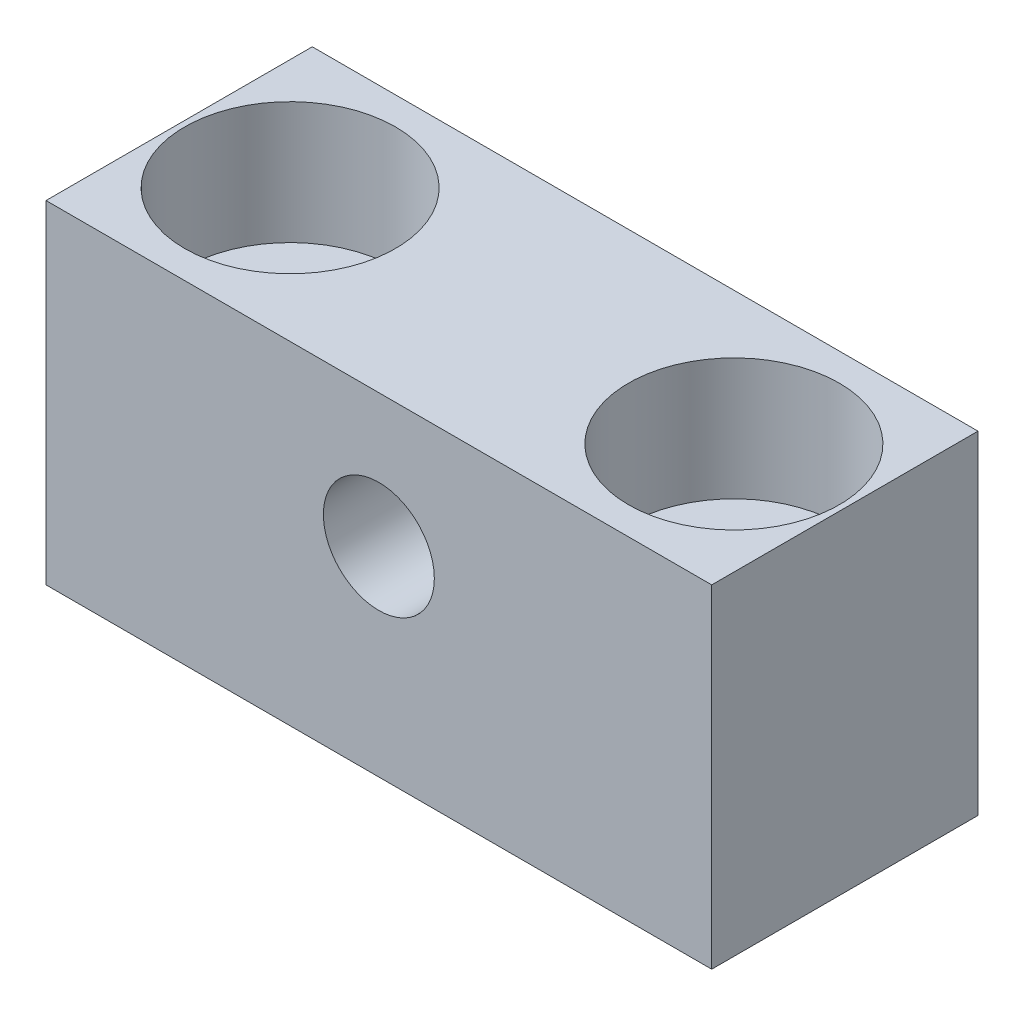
ISO-10303-21;
HEADER;
FILE_DESCRIPTION(('STEP AP214'),'2;1');
FILE_NAME('part.step','',(''),(''),'','','');
FILE_SCHEMA(('AUTOMOTIVE_DESIGN { 1 0 10303 214 1 1 1 1 }'));
ENDSEC;
DATA;
#1=APPLICATION_CONTEXT('core data for automotive mechanical design processes');
#2=APPLICATION_PROTOCOL_DEFINITION('international standard','automotive_design',2000,#1);
#3=PRODUCT_CONTEXT('',#1,'mechanical');
#4=PRODUCT('Part','Part','',(#3));
#5=PRODUCT_RELATED_PRODUCT_CATEGORY('part','',(#4));
#6=PRODUCT_DEFINITION_FORMATION('','',#4);
#7=PRODUCT_DEFINITION_CONTEXT('part definition',#1,'design');
#8=PRODUCT_DEFINITION('design','',#6,#7);
#9=PRODUCT_DEFINITION_SHAPE('','',#8);
#10=(LENGTH_UNIT() NAMED_UNIT(*) SI_UNIT(.MILLI.,.METRE.));
#11=(NAMED_UNIT(*) PLANE_ANGLE_UNIT() SI_UNIT($,.RADIAN.));
#12=(NAMED_UNIT(*) SI_UNIT($,.STERADIAN.) SOLID_ANGLE_UNIT());
#13=UNCERTAINTY_MEASURE_WITH_UNIT(LENGTH_MEASURE(1.E-05),#10,'distance_accuracy_value','');
#14=(GEOMETRIC_REPRESENTATION_CONTEXT(3) GLOBAL_UNCERTAINTY_ASSIGNED_CONTEXT((#13)) GLOBAL_UNIT_ASSIGNED_CONTEXT((#10,
#11,#12)) REPRESENTATION_CONTEXT('',''));
#15=CARTESIAN_POINT('',(0.,0.,0.));
#16=DIRECTION('',(0.,0.,1.));
#17=DIRECTION('',(1.,0.,0.));
#18=AXIS2_PLACEMENT_3D('',#15,#16,#17);
#19=CARTESIAN_POINT('',(5.,-0.000999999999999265,6.));
#20=DIRECTION('',(0.,1.,0.));
#21=DIRECTION('',(0.,0.,1.));
#22=AXIS2_PLACEMENT_3D('',#19,#20,#21);
#23=CYLINDRICAL_SURFACE('',#22,2.75);
#24=CARTESIAN_POINT('',(5.,0.,6.));
#25=DIRECTION('',(0.,1.,0.));
#26=DIRECTION('',(0.,0.,1.));
#27=AXIS2_PLACEMENT_3D('',#24,#25,#26);
#28=CIRCLE('',#27,2.75);
#29=CARTESIAN_POINT('',(5.,0.,8.75));
#30=VERTEX_POINT('',#29);
#31=EDGE_CURVE('E110',#30,#30,#28,.F.);
#32=CARTESIAN_POINT('',(5.,9.5,6.));
#33=DIRECTION('',(0.,1.,0.));
#34=DIRECTION('',(0.,0.,1.));
#35=AXIS2_PLACEMENT_3D('',#32,#33,#34);
#36=CIRCLE('',#35,2.75);
#37=CARTESIAN_POINT('',(5.,9.5,8.75));
#38=VERTEX_POINT('',#37);
#39=EDGE_CURVE('E36',#38,#38,#36,.F.);
#40=CARTESIAN_POINT('',(5.,0.,8.75));
#41=CARTESIAN_POINT('',(5.,0.0989583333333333,8.75));
#42=CARTESIAN_POINT('',(5.,0.197916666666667,8.75));
#43=CARTESIAN_POINT('',(5.,0.395833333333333,8.75));
#44=CARTESIAN_POINT('',(5.,0.494791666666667,8.75));
#45=CARTESIAN_POINT('',(5.,0.692708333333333,8.75));
#46=CARTESIAN_POINT('',(5.,0.791666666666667,8.75));
#47=CARTESIAN_POINT('',(5.,0.989583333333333,8.75));
#48=CARTESIAN_POINT('',(5.,1.08854166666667,8.75));
#49=CARTESIAN_POINT('',(5.,1.28645833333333,8.75));
#50=CARTESIAN_POINT('',(5.,1.38541666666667,8.75));
#51=CARTESIAN_POINT('',(5.,1.58333333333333,8.75));
#52=CARTESIAN_POINT('',(5.,1.68229166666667,8.75));
#53=CARTESIAN_POINT('',(5.,1.88020833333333,8.75));
#54=CARTESIAN_POINT('',(5.,1.97916666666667,8.75));
#55=CARTESIAN_POINT('',(5.,2.17708333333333,8.75));
#56=CARTESIAN_POINT('',(5.,2.27604166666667,8.75));
#57=CARTESIAN_POINT('',(5.,2.47395833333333,8.75));
#58=CARTESIAN_POINT('',(5.,2.57291666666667,8.75));
#59=CARTESIAN_POINT('',(5.,2.77083333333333,8.75));
#60=CARTESIAN_POINT('',(5.,2.86979166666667,8.75));
#61=CARTESIAN_POINT('',(5.,3.06770833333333,8.75));
#62=CARTESIAN_POINT('',(5.,3.16666666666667,8.75));
#63=CARTESIAN_POINT('',(5.,3.36458333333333,8.75));
#64=CARTESIAN_POINT('',(5.,3.46354166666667,8.75));
#65=CARTESIAN_POINT('',(5.,3.66145833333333,8.75));
#66=CARTESIAN_POINT('',(5.,3.76041666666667,8.75));
#67=CARTESIAN_POINT('',(5.,3.95833333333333,8.75));
#68=CARTESIAN_POINT('',(5.,4.05729166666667,8.75));
#69=CARTESIAN_POINT('',(5.,4.25520833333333,8.75));
#70=CARTESIAN_POINT('',(5.,4.35416666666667,8.75));
#71=CARTESIAN_POINT('',(5.,4.55208333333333,8.75));
#72=CARTESIAN_POINT('',(5.,4.65104166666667,8.75));
#73=CARTESIAN_POINT('',(5.,4.84895833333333,8.75));
#74=CARTESIAN_POINT('',(5.,4.94791666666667,8.75));
#75=CARTESIAN_POINT('',(5.,5.14583333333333,8.75));
#76=CARTESIAN_POINT('',(5.,5.24479166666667,8.75));
#77=CARTESIAN_POINT('',(5.,5.44270833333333,8.75));
#78=CARTESIAN_POINT('',(5.,5.54166666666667,8.75));
#79=CARTESIAN_POINT('',(5.,5.73958333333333,8.75));
#80=CARTESIAN_POINT('',(5.,5.83854166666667,8.75));
#81=CARTESIAN_POINT('',(5.,6.03645833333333,8.75));
#82=CARTESIAN_POINT('',(5.,6.13541666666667,8.75));
#83=CARTESIAN_POINT('',(5.,6.33333333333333,8.75));
#84=CARTESIAN_POINT('',(5.,6.43229166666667,8.75));
#85=CARTESIAN_POINT('',(5.,6.63020833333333,8.75));
#86=CARTESIAN_POINT('',(5.,6.72916666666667,8.75));
#87=CARTESIAN_POINT('',(5.,6.92708333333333,8.75));
#88=CARTESIAN_POINT('',(5.,7.02604166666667,8.75));
#89=CARTESIAN_POINT('',(5.,7.22395833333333,8.75));
#90=CARTESIAN_POINT('',(5.,7.32291666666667,8.75));
#91=CARTESIAN_POINT('',(5.,7.52083333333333,8.75));
#92=CARTESIAN_POINT('',(5.,7.61979166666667,8.75));
#93=CARTESIAN_POINT('',(5.,7.81770833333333,8.75));
#94=CARTESIAN_POINT('',(5.,7.91666666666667,8.75));
#95=CARTESIAN_POINT('',(5.,8.11458333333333,8.75));
#96=CARTESIAN_POINT('',(5.,8.21354166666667,8.75));
#97=CARTESIAN_POINT('',(5.,8.41145833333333,8.75));
#98=CARTESIAN_POINT('',(5.,8.51041666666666,8.75));
#99=CARTESIAN_POINT('',(5.,8.70833333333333,8.75));
#100=CARTESIAN_POINT('',(5.,8.80729166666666,8.75));
#101=CARTESIAN_POINT('',(5.,9.00520833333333,8.75));
#102=CARTESIAN_POINT('',(5.,9.10416666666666,8.75));
#103=CARTESIAN_POINT('',(5.,9.30208333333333,8.75));
#104=CARTESIAN_POINT('',(5.,9.40104166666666,8.75));
#105=CARTESIAN_POINT('',(5.,9.5,8.75));
#106=B_SPLINE_CURVE_WITH_KNOTS('',3,(#40,#41,#42,#43,#44,#45,#46,#47,#48,#49,#50,#51,#52,#53,
#54,#55,#56,#57,#58,#59,#60,#61,#62,#63,#64,#65,#66,#67,#68,#69,#70,#71,#72,#73,#74,#75,#76,#77,
#78,#79,#80,#81,#82,#83,#84,#85,#86,#87,#88,#89,#90,#91,#92,#93,#94,#95,#96,#97,#98,#99,#100,
#101,#102,#103,#104,#105),.UNSPECIFIED.,.F.,.F.,(4,2,2,2,2,2,2,2,2,2,2,2,2,2,2,2,2,2,2,2,2,2,2,
2,2,2,2,2,2,2,2,2,4),(0.,0.296875,0.59375,0.890625,1.1875,1.484375,1.78125,2.078125,2.375,
2.671875,2.96875,3.265625,3.5625,3.859375,4.15625,4.453125,4.75,5.046875,5.34375,5.640625,
5.9375,6.234375,6.53125,6.828125,7.125,7.421875,7.71875,8.015625,8.3125,8.609375,8.90625,
9.203125,9.5),.UNSPECIFIED.);
#107=EDGE_CURVE('BSEAM32',#30,#38,#106,.T.);
#108=ORIENTED_EDGE('',*,*,#31,.T.);
#109=ORIENTED_EDGE('',*,*,#39,.F.);
#110=ORIENTED_EDGE('',*,*,#107,.T.);
#111=ORIENTED_EDGE('',*,*,#107,.F.);
#112=EDGE_LOOP('',(#108,#110,#109,#111));
#113=FACE_BOUND('',#112,.T.);
#114=ADVANCED_FACE('F32',(#113),#23,.F.);
#115=CARTESIAN_POINT('',(25.,-0.000999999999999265,6.));
#116=DIRECTION('',(0.,1.,0.));
#117=DIRECTION('',(0.,0.,1.));
#118=AXIS2_PLACEMENT_3D('',#115,#116,#117);
#119=CYLINDRICAL_SURFACE('',#118,2.75);
#120=CARTESIAN_POINT('',(25.,0.,6.));
#121=DIRECTION('',(0.,1.,0.));
#122=DIRECTION('',(0.,0.,1.));
#123=AXIS2_PLACEMENT_3D('',#120,#121,#122);
#124=CIRCLE('',#123,2.75);
#125=CARTESIAN_POINT('',(25.,0.,8.75));
#126=VERTEX_POINT('',#125);
#127=EDGE_CURVE('E115',#126,#126,#124,.F.);
#128=CARTESIAN_POINT('',(25.,9.5,6.));
#129=DIRECTION('',(0.,1.,0.));
#130=DIRECTION('',(0.,0.,1.));
#131=AXIS2_PLACEMENT_3D('',#128,#129,#130);
#132=CIRCLE('',#131,2.75);
#133=CARTESIAN_POINT('',(25.,9.5,8.75));
#134=VERTEX_POINT('',#133);
#135=EDGE_CURVE('E108',#134,#134,#132,.F.);
#136=CARTESIAN_POINT('',(25.,0.,8.75));
#137=CARTESIAN_POINT('',(25.,0.0989583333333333,8.75));
#138=CARTESIAN_POINT('',(25.,0.197916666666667,8.75));
#139=CARTESIAN_POINT('',(25.,0.395833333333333,8.75));
#140=CARTESIAN_POINT('',(25.,0.494791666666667,8.75));
#141=CARTESIAN_POINT('',(25.,0.692708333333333,8.75));
#142=CARTESIAN_POINT('',(25.,0.791666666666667,8.75));
#143=CARTESIAN_POINT('',(25.,0.989583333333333,8.75));
#144=CARTESIAN_POINT('',(25.,1.08854166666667,8.75));
#145=CARTESIAN_POINT('',(25.,1.28645833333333,8.75));
#146=CARTESIAN_POINT('',(25.,1.38541666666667,8.75));
#147=CARTESIAN_POINT('',(25.,1.58333333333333,8.75));
#148=CARTESIAN_POINT('',(25.,1.68229166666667,8.75));
#149=CARTESIAN_POINT('',(25.,1.88020833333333,8.75));
#150=CARTESIAN_POINT('',(25.,1.97916666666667,8.75));
#151=CARTESIAN_POINT('',(25.,2.17708333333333,8.75));
#152=CARTESIAN_POINT('',(25.,2.27604166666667,8.75));
#153=CARTESIAN_POINT('',(25.,2.47395833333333,8.75));
#154=CARTESIAN_POINT('',(25.,2.57291666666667,8.75));
#155=CARTESIAN_POINT('',(25.,2.77083333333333,8.75));
#156=CARTESIAN_POINT('',(25.,2.86979166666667,8.75));
#157=CARTESIAN_POINT('',(25.,3.06770833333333,8.75));
#158=CARTESIAN_POINT('',(25.,3.16666666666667,8.75));
#159=CARTESIAN_POINT('',(25.,3.36458333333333,8.75));
#160=CARTESIAN_POINT('',(25.,3.46354166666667,8.75));
#161=CARTESIAN_POINT('',(25.,3.66145833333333,8.75));
#162=CARTESIAN_POINT('',(25.,3.76041666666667,8.75));
#163=CARTESIAN_POINT('',(25.,3.95833333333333,8.75));
#164=CARTESIAN_POINT('',(25.,4.05729166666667,8.75));
#165=CARTESIAN_POINT('',(25.,4.25520833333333,8.75));
#166=CARTESIAN_POINT('',(25.,4.35416666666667,8.75));
#167=CARTESIAN_POINT('',(25.,4.55208333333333,8.75));
#168=CARTESIAN_POINT('',(25.,4.65104166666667,8.75));
#169=CARTESIAN_POINT('',(25.,4.84895833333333,8.75));
#170=CARTESIAN_POINT('',(25.,4.94791666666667,8.75));
#171=CARTESIAN_POINT('',(25.,5.14583333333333,8.75));
#172=CARTESIAN_POINT('',(25.,5.24479166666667,8.75));
#173=CARTESIAN_POINT('',(25.,5.44270833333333,8.75));
#174=CARTESIAN_POINT('',(25.,5.54166666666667,8.75));
#175=CARTESIAN_POINT('',(25.,5.73958333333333,8.75));
#176=CARTESIAN_POINT('',(25.,5.83854166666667,8.75));
#177=CARTESIAN_POINT('',(25.,6.03645833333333,8.75));
#178=CARTESIAN_POINT('',(25.,6.13541666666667,8.75));
#179=CARTESIAN_POINT('',(25.,6.33333333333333,8.75));
#180=CARTESIAN_POINT('',(25.,6.43229166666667,8.75));
#181=CARTESIAN_POINT('',(25.,6.63020833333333,8.75));
#182=CARTESIAN_POINT('',(25.,6.72916666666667,8.75));
#183=CARTESIAN_POINT('',(25.,6.92708333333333,8.75));
#184=CARTESIAN_POINT('',(25.,7.02604166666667,8.75));
#185=CARTESIAN_POINT('',(25.,7.22395833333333,8.75));
#186=CARTESIAN_POINT('',(25.,7.32291666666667,8.75));
#187=CARTESIAN_POINT('',(25.,7.52083333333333,8.75));
#188=CARTESIAN_POINT('',(25.,7.61979166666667,8.75));
#189=CARTESIAN_POINT('',(25.,7.81770833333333,8.75));
#190=CARTESIAN_POINT('',(25.,7.91666666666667,8.75));
#191=CARTESIAN_POINT('',(25.,8.11458333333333,8.75));
#192=CARTESIAN_POINT('',(25.,8.21354166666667,8.75));
#193=CARTESIAN_POINT('',(25.,8.41145833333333,8.75));
#194=CARTESIAN_POINT('',(25.,8.51041666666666,8.75));
#195=CARTESIAN_POINT('',(25.,8.70833333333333,8.75));
#196=CARTESIAN_POINT('',(25.,8.80729166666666,8.75));
#197=CARTESIAN_POINT('',(25.,9.00520833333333,8.75));
#198=CARTESIAN_POINT('',(25.,9.10416666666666,8.75));
#199=CARTESIAN_POINT('',(25.,9.30208333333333,8.75));
#200=CARTESIAN_POINT('',(25.,9.40104166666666,8.75));
#201=CARTESIAN_POINT('',(25.,9.5,8.75));
#202=B_SPLINE_CURVE_WITH_KNOTS('',3,(#136,#137,#138,#139,#140,#141,#142,#143,#144,#145,#146,
#147,#148,#149,#150,#151,#152,#153,#154,#155,#156,#157,#158,#159,#160,#161,#162,#163,#164,#165,
#166,#167,#168,#169,#170,#171,#172,#173,#174,#175,#176,#177,#178,#179,#180,#181,#182,#183,#184,
#185,#186,#187,#188,#189,#190,#191,#192,#193,#194,#195,#196,#197,#198,#199,#200,#201),
.UNSPECIFIED.,.F.,.F.,(4,2,2,2,2,2,2,2,2,2,2,2,2,2,2,2,2,2,2,2,2,2,2,2,2,2,2,2,2,2,2,2,4),(0.,
0.296875,0.59375,0.890625,1.1875,1.484375,1.78125,2.078125,2.375,2.671875,2.96875,3.265625,
3.5625,3.859375,4.15625,4.453125,4.75,5.046875,5.34375,5.640625,5.9375,6.234375,6.53125,
6.828125,7.125,7.421875,7.71875,8.015625,8.3125,8.609375,8.90625,9.203125,9.5),.UNSPECIFIED.);
#203=EDGE_CURVE('BSEAM155',#126,#134,#202,.T.);
#204=ORIENTED_EDGE('',*,*,#127,.T.);
#205=ORIENTED_EDGE('',*,*,#135,.F.);
#206=ORIENTED_EDGE('',*,*,#203,.T.);
#207=ORIENTED_EDGE('',*,*,#203,.F.);
#208=EDGE_LOOP('',(#204,#206,#205,#207));
#209=FACE_BOUND('',#208,.T.);
#210=ADVANCED_FACE('F155',(#209),#119,.F.);
#211=CARTESIAN_POINT('',(0.,15.,12.));
#212=DIRECTION('',(0.,0.,-1.));
#213=DIRECTION('',(-1.,0.,0.));
#214=AXIS2_PLACEMENT_3D('',#211,#212,#213);
#215=PLANE('',#214);
#216=DIRECTION('',(0.,-1.,0.));
#217=VECTOR('',#216,1.);
#218=CARTESIAN_POINT('',(0.,0.,12.));
#219=LINE('',#218,#217);
#220=CARTESIAN_POINT('',(0.,15.,12.));
#221=VERTEX_POINT('',#220);
#222=CARTESIAN_POINT('',(0.,0.,12.));
#223=VERTEX_POINT('',#222);
#224=EDGE_CURVE('E87',#221,#223,#219,.T.);
#225=ORIENTED_EDGE('',*,*,#224,.T.);
#226=DIRECTION('',(1.,0.,0.));
#227=VECTOR('',#226,1.);
#228=CARTESIAN_POINT('',(0.,0.,12.));
#229=LINE('',#228,#227);
#230=CARTESIAN_POINT('',(30.,0.,12.));
#231=VERTEX_POINT('',#230);
#232=EDGE_CURVE('E81',#223,#231,#229,.T.);
#233=ORIENTED_EDGE('',*,*,#232,.T.);
#234=DIRECTION('',(0.,1.,0.));
#235=VECTOR('',#234,1.);
#236=CARTESIAN_POINT('',(30.,0.,12.));
#237=LINE('',#236,#235);
#238=CARTESIAN_POINT('',(30.,15.,12.));
#239=VERTEX_POINT('',#238);
#240=EDGE_CURVE('E85',#231,#239,#237,.T.);
#241=ORIENTED_EDGE('',*,*,#240,.T.);
#242=DIRECTION('',(-1.,0.,0.));
#243=VECTOR('',#242,1.);
#244=CARTESIAN_POINT('',(0.,15.,12.));
#245=LINE('',#244,#243);
#246=EDGE_CURVE('E51',#239,#221,#245,.T.);
#247=ORIENTED_EDGE('',*,*,#246,.T.);
#248=EDGE_LOOP('',(#225,#233,#241,#247));
#249=FACE_BOUND('',#248,.T.);
#250=CARTESIAN_POINT('',(15.,9.,12.));
#251=DIRECTION('',(0.,0.,1.));
#252=DIRECTION('',(1.,0.,0.));
#253=AXIS2_PLACEMENT_3D('',#250,#251,#252);
#254=CIRCLE('',#253,2.5);
#255=CARTESIAN_POINT('',(17.5,9.,12.));
#256=VERTEX_POINT('',#255);
#257=EDGE_CURVE('E103',#256,#256,#254,.T.);
#258=ORIENTED_EDGE('',*,*,#257,.F.);
#259=EDGE_LOOP('',(#258));
#260=FACE_BOUND('',#259,.T.);
#261=ADVANCED_FACE('F82',(#249,#260),#215,.F.);
#262=CARTESIAN_POINT('',(0.,15.,0.));
#263=DIRECTION('',(0.,0.,-1.));
#264=DIRECTION('',(-1.,0.,0.));
#265=AXIS2_PLACEMENT_3D('',#262,#263,#264);
#266=PLANE('',#265);
#267=DIRECTION('',(0.,-1.,0.));
#268=VECTOR('',#267,1.);
#269=CARTESIAN_POINT('',(0.,0.,0.));
#270=LINE('',#269,#268);
#271=CARTESIAN_POINT('',(0.,15.,0.));
#272=VERTEX_POINT('',#271);
#273=CARTESIAN_POINT('',(0.,0.,0.));
#274=VERTEX_POINT('',#273);
#275=EDGE_CURVE('E100',#272,#274,#270,.T.);
#276=ORIENTED_EDGE('',*,*,#275,.F.);
#277=DIRECTION('',(-1.,0.,0.));
#278=VECTOR('',#277,1.);
#279=CARTESIAN_POINT('',(0.,15.,0.));
#280=LINE('',#279,#278);
#281=CARTESIAN_POINT('',(30.,15.,0.));
#282=VERTEX_POINT('',#281);
#283=EDGE_CURVE('E74',#282,#272,#280,.T.);
#284=ORIENTED_EDGE('',*,*,#283,.F.);
#285=DIRECTION('',(0.,1.,0.));
#286=VECTOR('',#285,1.);
#287=CARTESIAN_POINT('',(30.,0.,0.));
#288=LINE('',#287,#286);
#289=CARTESIAN_POINT('',(30.,0.,0.));
#290=VERTEX_POINT('',#289);
#291=EDGE_CURVE('E68',#290,#282,#288,.T.);
#292=ORIENTED_EDGE('',*,*,#291,.F.);
#293=DIRECTION('',(1.,0.,0.));
#294=VECTOR('',#293,1.);
#295=CARTESIAN_POINT('',(0.,0.,0.));
#296=LINE('',#295,#294);
#297=EDGE_CURVE('E91',#274,#290,#296,.T.);
#298=ORIENTED_EDGE('',*,*,#297,.F.);
#299=EDGE_LOOP('',(#276,#284,#292,#298));
#300=FACE_BOUND('',#299,.T.);
#301=CARTESIAN_POINT('',(15.,9.,0.));
#302=DIRECTION('',(0.,0.,1.));
#303=DIRECTION('',(1.,0.,0.));
#304=AXIS2_PLACEMENT_3D('',#301,#302,#303);
#305=CIRCLE('',#304,2.5);
#306=CARTESIAN_POINT('',(17.5,9.,0.));
#307=VERTEX_POINT('',#306);
#308=EDGE_CURVE('E130',#307,#307,#305,.T.);
#309=ORIENTED_EDGE('',*,*,#308,.T.);
#310=EDGE_LOOP('',(#309));
#311=FACE_BOUND('',#310,.T.);
#312=ADVANCED_FACE('F136',(#300,#311),#266,.T.);
#313=CARTESIAN_POINT('',(0.,0.,12.));
#314=DIRECTION('',(1.,0.,0.));
#315=DIRECTION('',(0.,0.,-1.));
#316=AXIS2_PLACEMENT_3D('',#313,#314,#315);
#317=PLANE('',#316);
#318=ORIENTED_EDGE('',*,*,#275,.T.);
#319=DIRECTION('',(0.,0.,-1.));
#320=VECTOR('',#319,1.);
#321=CARTESIAN_POINT('',(0.,0.,12.));
#322=LINE('',#321,#320);
#323=EDGE_CURVE('E11',#223,#274,#322,.T.);
#324=ORIENTED_EDGE('',*,*,#323,.F.);
#325=ORIENTED_EDGE('',*,*,#224,.F.);
#326=DIRECTION('',(0.,0.,-1.));
#327=VECTOR('',#326,1.);
#328=CARTESIAN_POINT('',(0.,15.,12.));
#329=LINE('',#328,#327);
#330=EDGE_CURVE('E96',#221,#272,#329,.T.);
#331=ORIENTED_EDGE('',*,*,#330,.T.);
#332=EDGE_LOOP('',(#318,#324,#325,#331));
#333=FACE_BOUND('',#332,.T.);
#334=ADVANCED_FACE('F34',(#333),#317,.F.);
#335=CARTESIAN_POINT('',(0.,0.,12.));
#336=DIRECTION('',(0.,1.,0.));
#337=DIRECTION('',(0.,0.,1.));
#338=AXIS2_PLACEMENT_3D('',#335,#336,#337);
#339=PLANE('',#338);
#340=ORIENTED_EDGE('',*,*,#31,.F.);
#341=EDGE_LOOP('',(#340));
#342=FACE_BOUND('',#341,.T.);
#343=ORIENTED_EDGE('',*,*,#127,.F.);
#344=EDGE_LOOP('',(#343));
#345=FACE_BOUND('',#344,.T.);
#346=ORIENTED_EDGE('',*,*,#297,.T.);
#347=DIRECTION('',(0.,0.,-1.));
#348=VECTOR('',#347,1.);
#349=CARTESIAN_POINT('',(30.,0.,12.));
#350=LINE('',#349,#348);
#351=EDGE_CURVE('E42',#231,#290,#350,.T.);
#352=ORIENTED_EDGE('',*,*,#351,.F.);
#353=ORIENTED_EDGE('',*,*,#232,.F.);
#354=ORIENTED_EDGE('',*,*,#323,.T.);
#355=EDGE_LOOP('',(#346,#352,#353,#354));
#356=FACE_BOUND('',#355,.T.);
#357=ADVANCED_FACE('F90',(#342,#345,#356),#339,.F.);
#358=CARTESIAN_POINT('',(30.,0.,12.));
#359=DIRECTION('',(-1.,0.,0.));
#360=DIRECTION('',(0.,0.,1.));
#361=AXIS2_PLACEMENT_3D('',#358,#359,#360);
#362=PLANE('',#361);
#363=ORIENTED_EDGE('',*,*,#291,.T.);
#364=DIRECTION('',(0.,0.,-1.));
#365=VECTOR('',#364,1.);
#366=CARTESIAN_POINT('',(30.,15.,12.));
#367=LINE('',#366,#365);
#368=EDGE_CURVE('E92',#239,#282,#367,.T.);
#369=ORIENTED_EDGE('',*,*,#368,.F.);
#370=ORIENTED_EDGE('',*,*,#240,.F.);
#371=ORIENTED_EDGE('',*,*,#351,.T.);
#372=EDGE_LOOP('',(#363,#369,#370,#371));
#373=FACE_BOUND('',#372,.T.);
#374=ADVANCED_FACE('F94',(#373),#362,.F.);
#375=CARTESIAN_POINT('',(0.,15.,12.));
#376=DIRECTION('',(0.,-1.,0.));
#377=DIRECTION('',(0.,0.,-1.));
#378=AXIS2_PLACEMENT_3D('',#375,#376,#377);
#379=PLANE('',#378);
#380=CARTESIAN_POINT('',(5.,15.,6.));
#381=DIRECTION('',(0.,1.,0.));
#382=DIRECTION('',(0.,0.,1.));
#383=AXIS2_PLACEMENT_3D('',#380,#381,#382);
#384=CIRCLE('',#383,4.75);
#385=CARTESIAN_POINT('',(5.,15.,10.75));
#386=VERTEX_POINT('',#385);
#387=EDGE_CURVE('E125',#386,#386,#384,.T.);
#388=ORIENTED_EDGE('',*,*,#387,.F.);
#389=EDGE_LOOP('',(#388));
#390=FACE_BOUND('',#389,.T.);
#391=CARTESIAN_POINT('',(25.,15.,6.));
#392=DIRECTION('',(0.,1.,0.));
#393=DIRECTION('',(0.,0.,1.));
#394=AXIS2_PLACEMENT_3D('',#391,#392,#393);
#395=CIRCLE('',#394,4.75);
#396=CARTESIAN_POINT('',(25.,15.,10.75));
#397=VERTEX_POINT('',#396);
#398=EDGE_CURVE('E118',#397,#397,#395,.T.);
#399=ORIENTED_EDGE('',*,*,#398,.F.);
#400=EDGE_LOOP('',(#399));
#401=FACE_BOUND('',#400,.T.);
#402=ORIENTED_EDGE('',*,*,#283,.T.);
#403=ORIENTED_EDGE('',*,*,#330,.F.);
#404=ORIENTED_EDGE('',*,*,#246,.F.);
#405=ORIENTED_EDGE('',*,*,#368,.T.);
#406=EDGE_LOOP('',(#402,#403,#404,#405));
#407=FACE_BOUND('',#406,.T.);
#408=ADVANCED_FACE('F141',(#390,#401,#407),#379,.F.);
#409=CARTESIAN_POINT('',(15.,9.,12.));
#410=DIRECTION('',(0.,0.,-1.));
#411=DIRECTION('',(-1.,0.,0.));
#412=AXIS2_PLACEMENT_3D('',#409,#410,#411);
#413=CYLINDRICAL_SURFACE('',#412,2.5);
#414=ORIENTED_EDGE('',*,*,#257,.T.);
#415=EDGE_LOOP('',(#414));
#416=FACE_BOUND('',#415,.T.);
#417=ORIENTED_EDGE('',*,*,#308,.F.);
#418=EDGE_LOOP('',(#417));
#419=FACE_BOUND('',#418,.T.);
#420=ADVANCED_FACE('F138',(#416,#419),#413,.F.);
#421=CARTESIAN_POINT('',(25.,9.5,6.));
#422=DIRECTION('',(0.,1.,0.));
#423=DIRECTION('',(0.,0.,1.));
#424=AXIS2_PLACEMENT_3D('',#421,#422,#423);
#425=PLANE('',#424);
#426=CARTESIAN_POINT('',(25.,9.5,6.));
#427=DIRECTION('',(0.,1.,0.));
#428=DIRECTION('',(0.,0.,1.));
#429=AXIS2_PLACEMENT_3D('',#426,#427,#428);
#430=CIRCLE('',#429,4.75);
#431=CARTESIAN_POINT('',(25.,9.5,10.75));
#432=VERTEX_POINT('',#431);
#433=EDGE_CURVE('E111',#432,#432,#430,.T.);
#434=ORIENTED_EDGE('',*,*,#433,.T.);
#435=EDGE_LOOP('',(#434));
#436=FACE_BOUND('',#435,.T.);
#437=ORIENTED_EDGE('',*,*,#135,.T.);
#438=EDGE_LOOP('',(#437));
#439=FACE_BOUND('',#438,.T.);
#440=ADVANCED_FACE('F140',(#436,#439),#425,.T.);
#441=CARTESIAN_POINT('',(25.,9.5,6.));
#442=DIRECTION('',(0.,1.,0.));
#443=DIRECTION('',(0.,0.,1.));
#444=AXIS2_PLACEMENT_3D('',#441,#442,#443);
#445=CYLINDRICAL_SURFACE('',#444,4.75);
#446=ORIENTED_EDGE('',*,*,#433,.F.);
#447=EDGE_LOOP('',(#446));
#448=FACE_BOUND('',#447,.T.);
#449=ORIENTED_EDGE('',*,*,#398,.T.);
#450=EDGE_LOOP('',(#449));
#451=FACE_BOUND('',#450,.T.);
#452=ADVANCED_FACE('F148',(#448,#451),#445,.F.);
#453=CARTESIAN_POINT('',(5.,9.5,6.));
#454=DIRECTION('',(0.,1.,0.));
#455=DIRECTION('',(0.,0.,1.));
#456=AXIS2_PLACEMENT_3D('',#453,#454,#455);
#457=PLANE('',#456);
#458=CARTESIAN_POINT('',(5.,9.5,6.));
#459=DIRECTION('',(0.,1.,0.));
#460=DIRECTION('',(0.,0.,1.));
#461=AXIS2_PLACEMENT_3D('',#458,#459,#460);
#462=CIRCLE('',#461,4.75);
#463=CARTESIAN_POINT('',(5.,9.5,10.75));
#464=VERTEX_POINT('',#463);
#465=EDGE_CURVE('E179',#464,#464,#462,.T.);
#466=ORIENTED_EDGE('',*,*,#465,.T.);
#467=EDGE_LOOP('',(#466));
#468=FACE_BOUND('',#467,.T.);
#469=ORIENTED_EDGE('',*,*,#39,.T.);
#470=EDGE_LOOP('',(#469));
#471=FACE_BOUND('',#470,.T.);
#472=ADVANCED_FACE('F165',(#468,#471),#457,.T.);
#473=CARTESIAN_POINT('',(5.,9.5,6.));
#474=DIRECTION('',(0.,1.,0.));
#475=DIRECTION('',(0.,0.,1.));
#476=AXIS2_PLACEMENT_3D('',#473,#474,#475);
#477=CYLINDRICAL_SURFACE('',#476,4.75);
#478=ORIENTED_EDGE('',*,*,#465,.F.);
#479=EDGE_LOOP('',(#478));
#480=FACE_BOUND('',#479,.T.);
#481=ORIENTED_EDGE('',*,*,#387,.T.);
#482=EDGE_LOOP('',(#481));
#483=FACE_BOUND('',#482,.T.);
#484=ADVANCED_FACE('F168',(#480,#483),#477,.F.);
#485=CLOSED_SHELL('',(#114,#210,#261,#312,#334,#357,#374,#408,#420,#440,#452,#472,#484));
#486=MANIFOLD_SOLID_BREP('B2',#485);
#487=ADVANCED_BREP_SHAPE_REPRESENTATION('',(#18,#486),#14);
#488=SHAPE_DEFINITION_REPRESENTATION(#9,#487);
ENDSEC;
END-ISO-10303-21;
